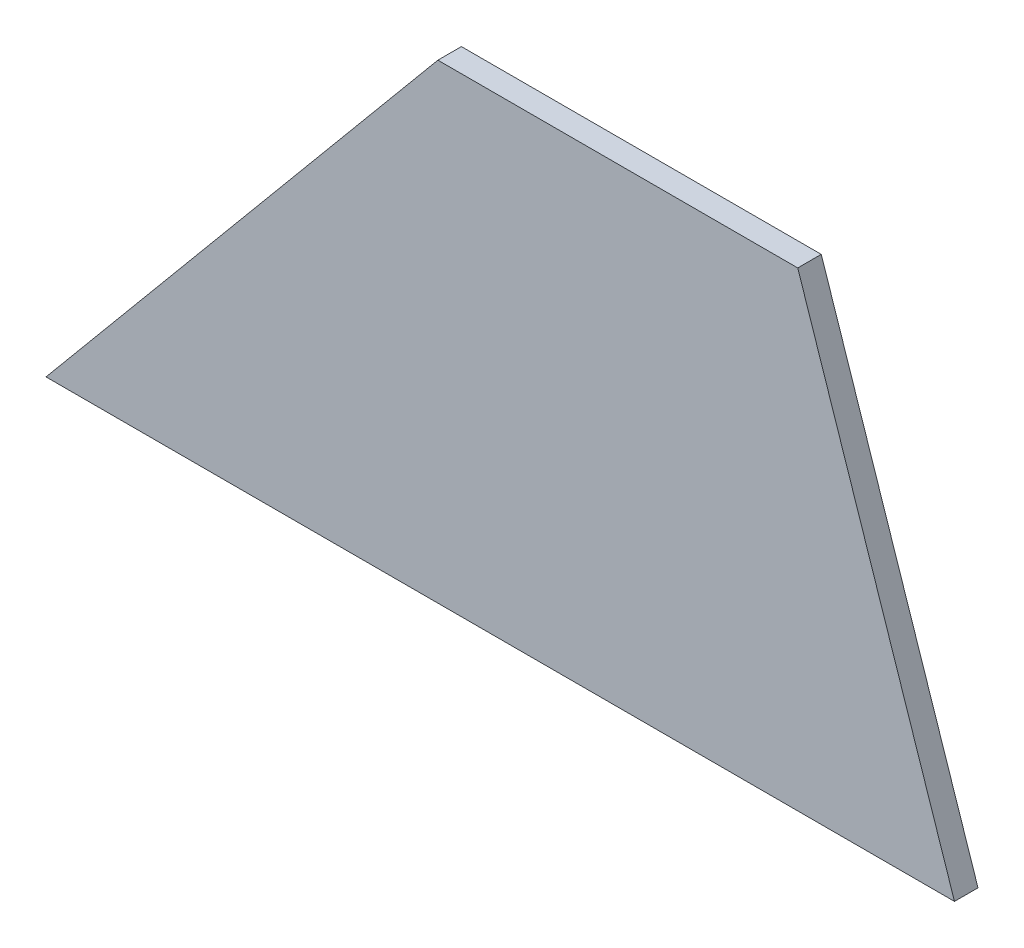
ISO-10303-21;
HEADER;
FILE_DESCRIPTION(('STEP AP214'),'2;1');
FILE_NAME('part.step','',(''),(''),'','','');
FILE_SCHEMA(('AUTOMOTIVE_DESIGN { 1 0 10303 214 1 1 1 1 }'));
ENDSEC;
DATA;
#1=APPLICATION_CONTEXT('core data for automotive mechanical design processes');
#2=APPLICATION_PROTOCOL_DEFINITION('international standard','automotive_design',2000,#1);
#3=PRODUCT_CONTEXT('',#1,'mechanical');
#4=PRODUCT('Part','Part','',(#3));
#5=PRODUCT_RELATED_PRODUCT_CATEGORY('part','',(#4));
#6=PRODUCT_DEFINITION_FORMATION('','',#4);
#7=PRODUCT_DEFINITION_CONTEXT('part definition',#1,'design');
#8=PRODUCT_DEFINITION('design','',#6,#7);
#9=PRODUCT_DEFINITION_SHAPE('','',#8);
#10=(LENGTH_UNIT() NAMED_UNIT(*) SI_UNIT(.MILLI.,.METRE.));
#11=(NAMED_UNIT(*) PLANE_ANGLE_UNIT() SI_UNIT($,.RADIAN.));
#12=(NAMED_UNIT(*) SI_UNIT($,.STERADIAN.) SOLID_ANGLE_UNIT());
#13=UNCERTAINTY_MEASURE_WITH_UNIT(LENGTH_MEASURE(1.E-05),#10,'distance_accuracy_value','');
#14=(GEOMETRIC_REPRESENTATION_CONTEXT(3) GLOBAL_UNCERTAINTY_ASSIGNED_CONTEXT((#13)) GLOBAL_UNIT_ASSIGNED_CONTEXT((#10,
#11,#12)) REPRESENTATION_CONTEXT('',''));
#15=CARTESIAN_POINT('',(0.,0.,0.));
#16=DIRECTION('',(0.,0.,1.));
#17=DIRECTION('',(1.,0.,0.));
#18=AXIS2_PLACEMENT_3D('',#15,#16,#17);
#19=CARTESIAN_POINT('',(63.7536512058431,187.354032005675,3.81));
#20=DIRECTION('',(0.768221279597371,-0.640184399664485,0.));
#21=DIRECTION('',(0.640184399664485,0.768221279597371,0.));
#22=AXIS2_PLACEMENT_3D('',#19,#20,#21);
#23=PLANE('',#22);
#24=DIRECTION('',(-0.640184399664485,-0.768221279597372,0.));
#25=VECTOR('',#24,1.);
#26=CARTESIAN_POINT('',(63.7536512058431,187.354032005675,0.));
#27=LINE('',#26,#25);
#28=CARTESIAN_POINT('',(63.7536512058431,187.354032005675,0.));
#29=VERTEX_POINT('',#28);
#30=CARTESIAN_POINT('',(0.253651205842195,111.154032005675,0.));
#31=VERTEX_POINT('',#30);
#32=EDGE_CURVE('E75',#29,#31,#27,.T.);
#33=ORIENTED_EDGE('',*,*,#32,.T.);
#34=DIRECTION('',(0.,0.,-1.));
#35=VECTOR('',#34,1.);
#36=CARTESIAN_POINT('',(0.253651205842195,111.154032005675,3.81));
#37=LINE('',#36,#35);
#38=CARTESIAN_POINT('',(0.253651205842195,111.154032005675,3.81));
#39=VERTEX_POINT('',#38);
#40=EDGE_CURVE('E11',#39,#31,#37,.T.);
#41=ORIENTED_EDGE('',*,*,#40,.F.);
#42=DIRECTION('',(-0.640184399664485,-0.768221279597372,0.));
#43=VECTOR('',#42,1.);
#44=CARTESIAN_POINT('',(63.7536512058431,187.354032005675,3.81));
#45=LINE('',#44,#43);
#46=CARTESIAN_POINT('',(63.7536512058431,187.354032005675,3.81));
#47=VERTEX_POINT('',#46);
#48=EDGE_CURVE('E93',#47,#39,#45,.T.);
#49=ORIENTED_EDGE('',*,*,#48,.F.);
#50=DIRECTION('',(0.,0.,-1.));
#51=VECTOR('',#50,1.);
#52=CARTESIAN_POINT('',(63.7536512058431,187.354032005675,3.81));
#53=LINE('',#52,#51);
#54=EDGE_CURVE('E87',#47,#29,#53,.T.);
#55=ORIENTED_EDGE('',*,*,#54,.T.);
#56=EDGE_LOOP('',(#33,#41,#49,#55));
#57=FACE_BOUND('',#56,.T.);
#58=ADVANCED_FACE('F31',(#57),#23,.F.);
#59=CARTESIAN_POINT('',(0.253651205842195,111.154032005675,3.81));
#60=DIRECTION('',(0.,1.,0.));
#61=DIRECTION('',(-1.,0.,0.));
#62=AXIS2_PLACEMENT_3D('',#59,#60,#61);
#63=PLANE('',#62);
#64=DIRECTION('',(1.,0.,0.));
#65=VECTOR('',#64,1.);
#66=CARTESIAN_POINT('',(0.253651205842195,111.154032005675,0.));
#67=LINE('',#66,#65);
#68=CARTESIAN_POINT('',(147.464188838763,111.154032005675,0.));
#69=VERTEX_POINT('',#68);
#70=EDGE_CURVE('E71',#31,#69,#67,.T.);
#71=ORIENTED_EDGE('',*,*,#70,.T.);
#72=DIRECTION('',(0.,0.,-1.));
#73=VECTOR('',#72,1.);
#74=CARTESIAN_POINT('',(147.464188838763,111.154032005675,3.81));
#75=LINE('',#74,#73);
#76=CARTESIAN_POINT('',(147.464188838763,111.154032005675,3.81));
#77=VERTEX_POINT('',#76);
#78=EDGE_CURVE('E38',#77,#69,#75,.T.);
#79=ORIENTED_EDGE('',*,*,#78,.F.);
#80=DIRECTION('',(1.,0.,0.));
#81=VECTOR('',#80,1.);
#82=CARTESIAN_POINT('',(0.253651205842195,111.154032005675,3.81));
#83=LINE('',#82,#81);
#84=EDGE_CURVE('E83',#39,#77,#83,.T.);
#85=ORIENTED_EDGE('',*,*,#84,.F.);
#86=ORIENTED_EDGE('',*,*,#40,.T.);
#87=EDGE_LOOP('',(#71,#79,#85,#86));
#88=FACE_BOUND('',#87,.T.);
#89=ADVANCED_FACE('F82',(#88),#63,.F.);
#90=CARTESIAN_POINT('',(122.064188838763,187.354032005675,3.81));
#91=DIRECTION('',(-0.948683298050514,-0.316227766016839,0.));
#92=DIRECTION('',(0.316227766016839,-0.948683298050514,0.));
#93=AXIS2_PLACEMENT_3D('',#90,#91,#92);
#94=PLANE('',#93);
#95=DIRECTION('',(-0.316227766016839,0.948683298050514,0.));
#96=VECTOR('',#95,1.);
#97=CARTESIAN_POINT('',(122.064188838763,187.354032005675,0.));
#98=LINE('',#97,#96);
#99=CARTESIAN_POINT('',(122.064188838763,187.354032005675,0.));
#100=VERTEX_POINT('',#99);
#101=EDGE_CURVE('E76',#69,#100,#98,.T.);
#102=ORIENTED_EDGE('',*,*,#101,.T.);
#103=DIRECTION('',(0.,0.,-1.));
#104=VECTOR('',#103,1.);
#105=CARTESIAN_POINT('',(122.064188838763,187.354032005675,3.81));
#106=LINE('',#105,#104);
#107=CARTESIAN_POINT('',(122.064188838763,187.354032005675,3.81));
#108=VERTEX_POINT('',#107);
#109=EDGE_CURVE('E99',#108,#100,#106,.T.);
#110=ORIENTED_EDGE('',*,*,#109,.F.);
#111=DIRECTION('',(-0.316227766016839,0.948683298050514,0.));
#112=VECTOR('',#111,1.);
#113=CARTESIAN_POINT('',(122.064188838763,187.354032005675,3.81));
#114=LINE('',#113,#112);
#115=EDGE_CURVE('E50',#77,#108,#114,.T.);
#116=ORIENTED_EDGE('',*,*,#115,.F.);
#117=ORIENTED_EDGE('',*,*,#78,.T.);
#118=EDGE_LOOP('',(#102,#110,#116,#117));
#119=FACE_BOUND('',#118,.T.);
#120=ADVANCED_FACE('F102',(#119),#94,.F.);
#121=CARTESIAN_POINT('',(63.7536512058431,187.354032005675,3.81));
#122=DIRECTION('',(0.,-1.,0.));
#123=DIRECTION('',(0.,0.,-1.));
#124=AXIS2_PLACEMENT_3D('',#121,#122,#123);
#125=PLANE('',#124);
#126=DIRECTION('',(-1.,0.,0.));
#127=VECTOR('',#126,1.);
#128=CARTESIAN_POINT('',(63.7536512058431,187.354032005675,0.));
#129=LINE('',#128,#127);
#130=EDGE_CURVE('E91',#100,#29,#129,.T.);
#131=ORIENTED_EDGE('',*,*,#130,.T.);
#132=ORIENTED_EDGE('',*,*,#54,.F.);
#133=DIRECTION('',(-1.,0.,0.));
#134=VECTOR('',#133,1.);
#135=CARTESIAN_POINT('',(63.7536512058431,187.354032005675,3.81));
#136=LINE('',#135,#134);
#137=EDGE_CURVE('E45',#108,#47,#136,.T.);
#138=ORIENTED_EDGE('',*,*,#137,.F.);
#139=ORIENTED_EDGE('',*,*,#109,.T.);
#140=EDGE_LOOP('',(#131,#132,#138,#139));
#141=FACE_BOUND('',#140,.T.);
#142=ADVANCED_FACE('F104',(#141),#125,.F.);
#143=CARTESIAN_POINT('',(105.404035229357,237.334492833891,3.81));
#144=DIRECTION('',(0.,0.,1.));
#145=DIRECTION('',(1.,0.,0.));
#146=AXIS2_PLACEMENT_3D('',#143,#144,#145);
#147=PLANE('',#146);
#148=ORIENTED_EDGE('',*,*,#48,.T.);
#149=ORIENTED_EDGE('',*,*,#84,.T.);
#150=ORIENTED_EDGE('',*,*,#115,.T.);
#151=ORIENTED_EDGE('',*,*,#137,.T.);
#152=EDGE_LOOP('',(#148,#149,#150,#151));
#153=FACE_BOUND('',#152,.T.);
#154=ADVANCED_FACE('F105',(#153),#147,.T.);
#155=CARTESIAN_POINT('',(105.404035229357,237.334492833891,0.));
#156=DIRECTION('',(0.,0.,1.));
#157=DIRECTION('',(1.,0.,0.));
#158=AXIS2_PLACEMENT_3D('',#155,#156,#157);
#159=PLANE('',#158);
#160=ORIENTED_EDGE('',*,*,#32,.F.);
#161=ORIENTED_EDGE('',*,*,#130,.F.);
#162=ORIENTED_EDGE('',*,*,#101,.F.);
#163=ORIENTED_EDGE('',*,*,#70,.F.);
#164=EDGE_LOOP('',(#160,#161,#162,#163));
#165=FACE_BOUND('',#164,.T.);
#166=ADVANCED_FACE('F72',(#165),#159,.F.);
#167=CLOSED_SHELL('',(#58,#89,#120,#142,#154,#166));
#168=MANIFOLD_SOLID_BREP('B2',#167);
#169=ADVANCED_BREP_SHAPE_REPRESENTATION('',(#18,#168),#14);
#170=SHAPE_DEFINITION_REPRESENTATION(#9,#169);
ENDSEC;
END-ISO-10303-21;
